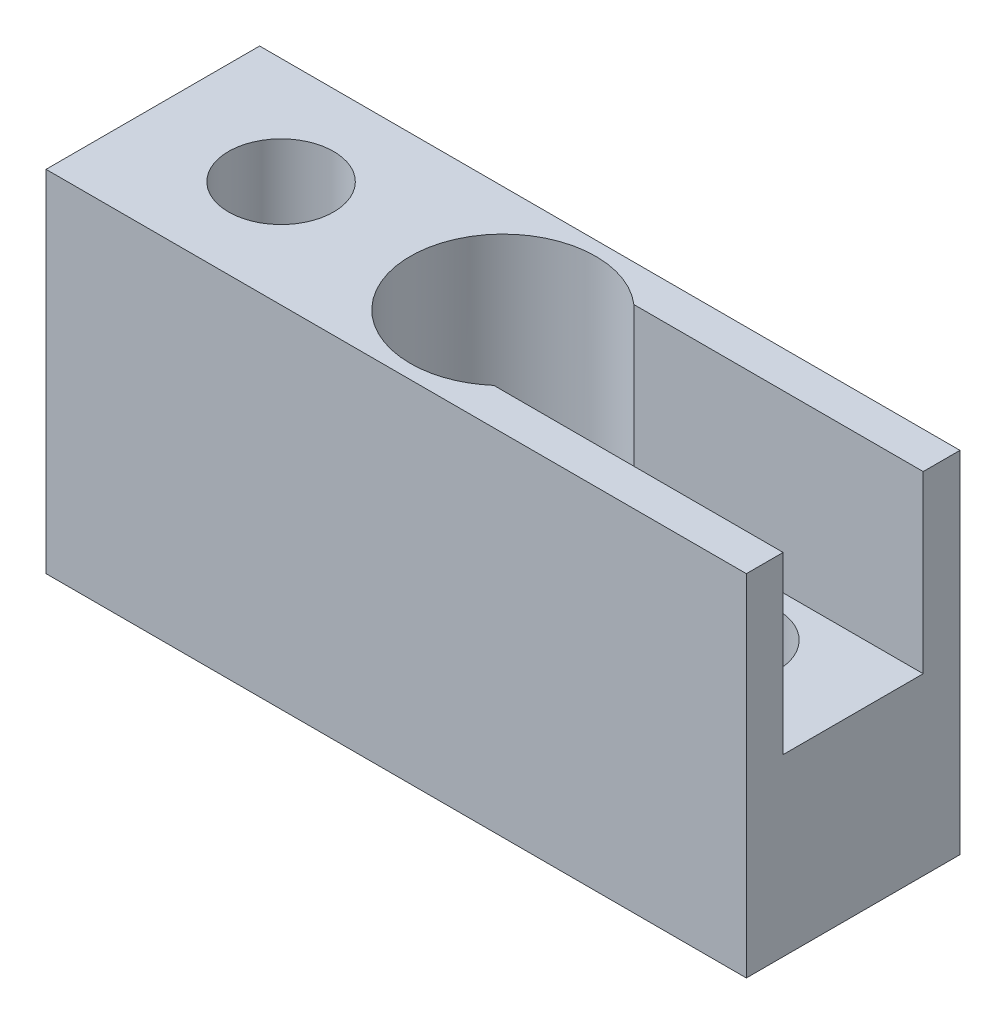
from build123d import *

# Parameters (mm, degrees)
SKIZZE1_R                                           = 5
LINEAR_AUSTRAGEN1_DEPTH                             = 1
SKIZZE2_W                                           = 40
SKIZZE2_H                                           = 12.2
LINEAR_AUSTRAGEN2_DEPTH                             = 2.4
SKIZZE3_R                                           = 2.35
SCHNITT_LINEAR_AUSTRAGEN1_DEPTH                     = 42.957120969
SKIZZE4_W                                           = 40
SKIZZE4_H                                           = 12.2
LINEAR_AUSTRAGEN3_DEPTH                             = 1.6
SKIZZE5_R                                           = 3.5
SCHNITT_LINEAR_AUSTRAGEN2_DEPTH                     = 1.6
SKIZZE6_W                                           = 40
SKIZZE6_H                                           = 12.2
LINEAR_AUSTRAGEN4_DEPTH                             = 2.4
SCHNITT_LINEAR_START                                = -2.4
SKIZZE7_R                                           = 2.35
SCHNITT_LINEAR_AUSTRAGEN3_DEPTH                     = 2.4
SKIZZE9_W                                           = 40
SKIZZE9_H                                           = 12.2
LINEAR_AUSTRAGEN5_DEPTH                             = 13.6
SKIZZE11_R                                          = 5.3
SCHNITT_LINEAR_AUSTRAGEN5_DEPTH                     = 13.6
STIRNSENKUNG_F_R_M3_SENKSCHRAUBE_KOPF_B_D           = 3.3
STIRNSENKUNG_F_R_M3_SENKSCHRAUBE_KOPF_B_CBORE_D     = 6
STIRNSENKUNG_F_R_M3_SENKSCHRAUBE_KOPF_B_CBORE_DEPTH = 17
STIRNSENKUNG_F_R_M3_SENKSCHRAUBE_KO_2_D             = 3.3
STIRNSENKUNG_F_R_M3_SENKSCHRAUBE_KO_2_CBORE_D       = 6
STIRNSENKUNG_F_R_M3_SENKSCHRAUBE_KO_2_CBORE_DEPTH   = 17
STIRNSENKUNG_F_R_M3_SENKSCHRAUBE_KO_2_O_D           = 3.3
STIRNSENKUNG_F_R_M3_SENKSCHRAUBE_KO_2_O_CBORE_D     = 6
STIRNSENKUNG_F_R_M3_SENKSCHRAUBE_KO_2_O_CBORE_DEPTH = 17
SKIZZE14_W                                          = 20
SKIZZE14_H                                          = 8
SCHNITT_LINEAR_AUSTRAGEN6_DEPTH                     = 10


with BuildPart() as part:
    # Skizze1 → Linear austragen1 (new body)
    with BuildSketch(Plane(origin=(0, 0, 0), x_dir=(1, 0, 0), z_dir=(0, 1, 0))):
        with Locations(Location((-20, -6.1, 0), (0, 0, 270))):
            Circle(SKIZZE1_R)
    extrude(amount=LINEAR_AUSTRAGEN1_DEPTH)

    # Skizze2 → Linear austragen2 (add)
    with BuildSketch(Plane(origin=(0, 1, 0), x_dir=(-1, 0, 0), z_dir=(0, 1, 0))):
        with Locations((20, 6.1)):
            Rectangle(SKIZZE2_W, SKIZZE2_H)
    extrude(amount=LINEAR_AUSTRAGEN2_DEPTH)

    # Skizze3 → Schnitt-Linear austragen1 (cut, through all)
    with BuildSketch(Plane.XZ):
        with Locations(Location((-20, 6.1, 0), (0, 0, 270))):
            Circle(SKIZZE3_R)
    extrude(amount=-SCHNITT_LINEAR_AUSTRAGEN1_DEPTH, mode=Mode.SUBTRACT)

    # Skizze4 → Linear austragen3 (add)
    with BuildSketch(Plane(origin=(0, 3.4, 0), x_dir=(-1, 0, 0), z_dir=(0, 1, 0))):
        with Locations((20, 6.1)):
            Rectangle(SKIZZE4_W, SKIZZE4_H)
    extrude(amount=LINEAR_AUSTRAGEN3_DEPTH)

    # Skizze5 → Schnitt-Linear austragen2 (cut)
    with BuildSketch(Plane(origin=(0, 5, 0), x_dir=(-1, 0, 0), z_dir=(0, 1, 0))):
        with Locations((-20, -6.1)):
            Circle(SKIZZE5_R)
        with Locations(Location((20, 6.1, 0), (0, 0, 90))):
            Circle(SKIZZE5_R)
    extrude(amount=-SCHNITT_LINEAR_AUSTRAGEN2_DEPTH, mode=Mode.SUBTRACT)

    # Skizze6 → Linear austragen4 (add)
    with BuildSketch(Plane(origin=(0, 5, 0), x_dir=(-1, 0, 0), z_dir=(0, 1, 0))):
        with Locations((20, 6.1)):
            Rectangle(SKIZZE6_W, SKIZZE6_H)
    extrude(amount=LINEAR_AUSTRAGEN4_DEPTH)

    # Skizze7 → Schnitt-Linear austragen3 (cut)
    with BuildSketch(Plane(origin=(0, 7.4, 0), x_dir=(-1, 0, 0), z_dir=(0, 1, 0)).offset(SCHNITT_LINEAR_START)):
        with Locations(Location((20, 6.1, 0), (0, 0, 270))):
            Circle(SKIZZE7_R)
    extrude(amount=SCHNITT_LINEAR_AUSTRAGEN3_DEPTH, mode=Mode.SUBTRACT)

    # Skizze9 → Linear austragen5 (add)
    with BuildSketch(Plane(origin=(0, 7.4, 0), x_dir=(-1, 0, 0), z_dir=(0, 1, 0))):
        with Locations((20, 6.1)):
            Rectangle(SKIZZE9_W, SKIZZE9_H)
    extrude(amount=LINEAR_AUSTRAGEN5_DEPTH)

    # Skizze11 → Schnitt-Linear austragen5 (cut)
    with BuildSketch(Plane(origin=(0, 21, 0), x_dir=(-1, 0, 0), z_dir=(0, 1, 0))):
        with Locations(Location((20, 6.1, 0), (0, 0, 90))):
            Circle(SKIZZE11_R)
    extrude(amount=-SCHNITT_LINEAR_AUSTRAGEN5_DEPTH, mode=Mode.SUBTRACT)

    # Stirnsenkung f_r M3 Senkschraube _Kopf B (through all)
    with Locations(Plane(origin=(-32.675, 21, 6.1), x_dir=(0, 0, 1), z_dir=(0, 1, 0))):
        with Locations((0, 0)):
            CounterBoreHole(STIRNSENKUNG_F_R_M3_SENKSCHRAUBE_KOPF_B_D / 2, STIRNSENKUNG_F_R_M3_SENKSCHRAUBE_KOPF_B_CBORE_D / 2, STIRNSENKUNG_F_R_M3_SENKSCHRAUBE_KOPF_B_CBORE_DEPTH)

    # Stirnsenkung f_r M3 Senkschraube _Ko 2 (through all)
    with Locations(Plane(origin=(-7.325, 21, 6.1), x_dir=(0, 0, 1), z_dir=(0, 1, 0))):
        with Locations((0, 0)):
            CounterBoreHole(STIRNSENKUNG_F_R_M3_SENKSCHRAUBE_KO_2_D / 2, STIRNSENKUNG_F_R_M3_SENKSCHRAUBE_KO_2_CBORE_D / 2, STIRNSENKUNG_F_R_M3_SENKSCHRAUBE_KO_2_CBORE_DEPTH)

    # Stirnsenkung f_r M3 Senkschraube _Ko 2 o (through all)
    with Locations(Plane(origin=(-34.211886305, 0, -4.343583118), x_dir=(0, 0, 1), z_dir=(0, 1, 0))):
        with Locations((0, 0)):
            CounterBoreHole(STIRNSENKUNG_F_R_M3_SENKSCHRAUBE_KO_2_O_D / 2, STIRNSENKUNG_F_R_M3_SENKSCHRAUBE_KO_2_O_CBORE_D / 2, STIRNSENKUNG_F_R_M3_SENKSCHRAUBE_KO_2_O_CBORE_DEPTH)

    # Skizze14 → Schnitt-Linear austragen6 (cut)
    with BuildSketch(Plane(origin=(0, 21, 0), x_dir=(-1, 0, 0), z_dir=(0, 1, 0))):
        with Locations((10, 6.1)):
            Rectangle(SKIZZE14_W, SKIZZE14_H)
    extrude(amount=-SCHNITT_LINEAR_AUSTRAGEN6_DEPTH, mode=Mode.SUBTRACT)


solid = part.part
